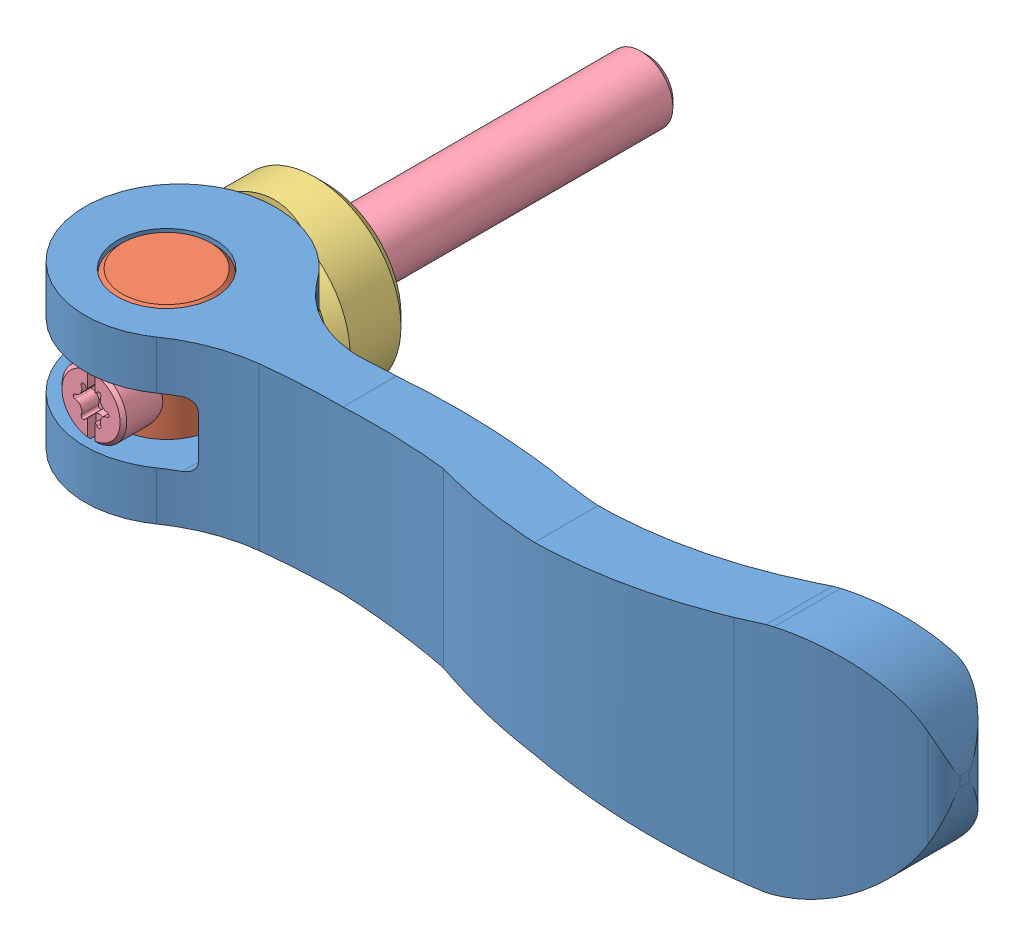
SolidWorks assembly KCL06X30-SUS.SLDASM, configuration Default (file format 15000). Lengths in mm.
Overall size (79.19 21.52 52.07).
4 component instances, 4 part files, 0 mates.
Components (placement in the parent):
- KCL06X30-SUS_01-1: KCL06X30-SUS_01.SLDPRT [ﾃﾞﾌｫﾙﾄ] at (0 0 14.7) x (1 0 0) z (0 -1 0) size (79.19 17.58 21.52)
- KCL06X30-SUS_02-1: KCL06X30-SUS_02.SLDPRT [ﾃﾞﾌｫﾙﾄ] at (0 0 14.7) x (0 1 0) z (1 0 0) size (15 9 9)
- KCL06X30-SUS_03-1: KCL06X30-SUS_03.SLDPRT [ﾃﾞﾌｫﾙﾄ] x (1 0 0) z (0 -1 0) size (16 7.24 16)
- KCL06X30-SUS_04-1: KCL06X30-SUS_04.SLDPRT [ﾃﾞﾌｫﾙﾄ] at (0 0 -19.8) x (0 1 0) z (1 0 0) size (6 51.5 6)
